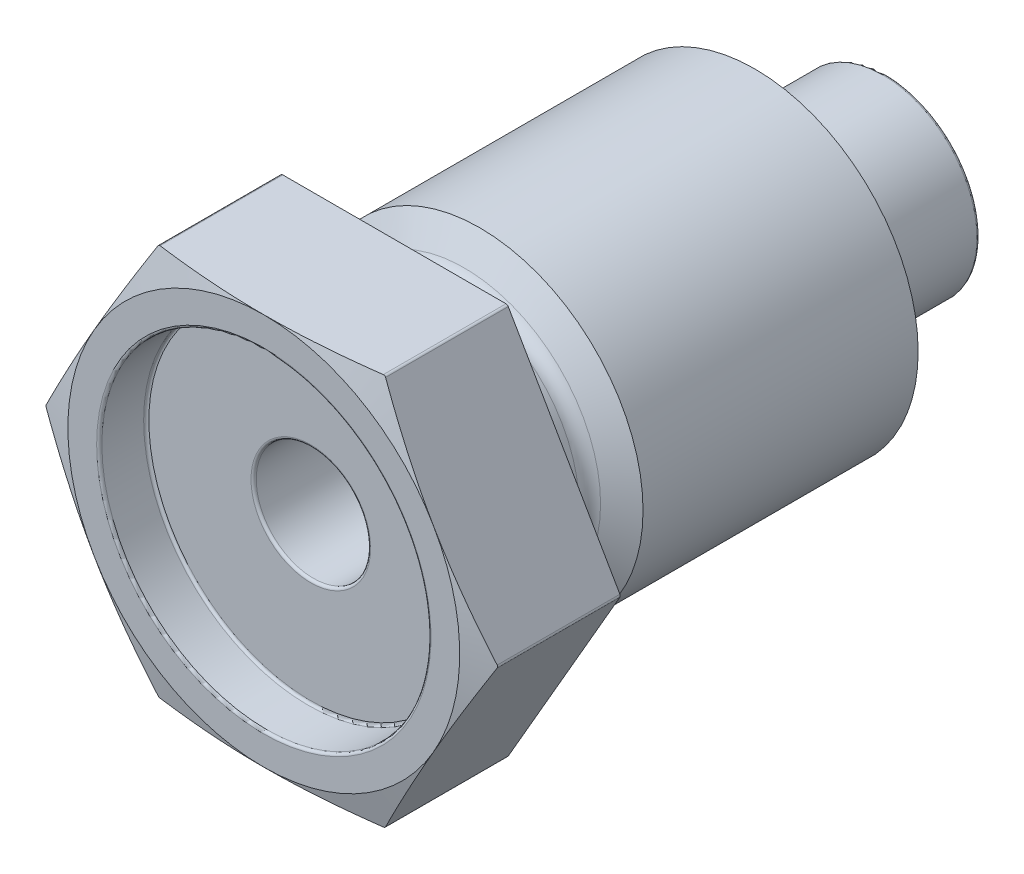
from build123d import *

# Parameters (mm, degrees)
EXTRUDE1_DEPTH     = 6.35
SKETCH2_R          = 7.9375
EXTRUDE2_DEPTH     = 23.876
SKETCH3_W          = 6.35
SKETCH3_H          = 3.3655
SKETCH5_R          = 2.7813
CUT_EXTRUDE1_DEPTH = 34.545554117
SKETCH6_R          = 8.001
CUT_EXTRUDE2_DEPTH = 2.286
FILLET1_R          = 0.762
FILLET2_R          = 0.127


with BuildPart() as part:
    # Sketch1 → Extrude1 (new body)
    with BuildSketch(Plane.XY):
        Polygon((10.998522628, 0), (5.499261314, 9.525), (-5.499261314, 9.525), (-10.998522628, 0), (-5.499261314, -9.525), (5.499261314, -9.525), align=None)
    extrude(amount=-EXTRUDE1_DEPTH)

    # Sketch2 → Extrude2 (add)
    with BuildSketch(Plane(origin=(0, 0, -6.35), x_dir=(-1, 0, 0), z_dir=(0, 0, -1))):
        Circle(SKETCH2_R)
    extrude(amount=EXTRUDE2_DEPTH)

    # Sketch3 → Cut-Revolve1 (revolve, cut)
    with BuildSketch(Plane(origin=(0, 0, 0), x_dir=(0, 0, -1), z_dir=(1, 0, 0)), mode=Mode.PRIVATE) as cut_revolve1_sk:
        with Locations((27.051, 6.25475)):
            Rectangle(SKETCH3_W, SKETCH3_H)
        with BuildLine():
            Line((6.35, 7.9375), (6.35, 6.24713))
            Line((6.35, 6.24713), (9.085059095, 6.24713))
            ThreePointArc((9.085059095, 6.24713), (9.466059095, 6.349218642), (9.744970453, 6.62813))
            Line((9.744970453, 6.62813), (10.500935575, 7.9375))
            Line((10.500935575, 7.9375), (6.35, 7.9375))
        make_face()
    revolve(cut_revolve1_sk.sketch.rotate(Axis((0, 0, 1.160189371), (0, 0, -1)), 90), axis=Axis((0, 0, 1.160189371), (0, 0, -1)), mode=Mode.SUBTRACT)

    # Sketch4 → Cut-Revolve2 (revolve, cut)
    with BuildSketch(Plane(origin=(0, 0, 0), x_dir=(0, 0, -1), z_dir=(1, 0, 0)), mode=Mode.PRIVATE) as cut_revolve2_sk:
        Polygon((0, 9.525), (0, 15.049654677), (1.480326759, 15.049654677), align=None)
    revolve(cut_revolve2_sk.sketch.rotate(Axis((0, 0, 4.039675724), (0, 0, -1)), 90), axis=Axis((0, 0, 4.039675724), (0, 0, -1)), mode=Mode.SUBTRACT)

    # Sketch5 → Cut-Extrude1 (cut, through all)
    with BuildSketch(Plane.XY):
        Circle(SKETCH5_R)
    extrude(amount=-CUT_EXTRUDE1_DEPTH, mode=Mode.SUBTRACT)

    # Sketch6 → Cut-Extrude2 (cut)
    with BuildSketch(Plane.XY):
        Circle(SKETCH6_R)
    extrude(amount=-CUT_EXTRUDE2_DEPTH, mode=Mode.SUBTRACT)

    # Fillet1
    fillet1_edges = [part.edges().sort_by_distance(p)[0] for p in [
        (-4.572, 0, -23.876),
        (-6.24713, 0, -6.35),
    ]]
    fillet(fillet1_edges, radius=FILLET1_R)

    # Fillet2
    fillet2_edges = [part.edges().sort_by_distance(p)[0] for p in [
        (-2.7813, 0, -30.226),
        (-2.7813, 0, -2.286),
        (-8.001, 0, -2.286),
        (-8.001, 0, 0),
        (-4.572, 0, -30.226),
        (-10.998522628, 0, -3.372414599),
        (-5.499261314, -9.525, -3.372414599),
        (5.499261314, -9.525, -3.372414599),
        (10.998522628, 0, -3.372414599),
        (-5.499261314, 9.525, -3.372414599),
        (5.499261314, 9.525, -3.372414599),
    ]]
    fillet(fillet2_edges, radius=FILLET2_R)


solid = part.part
